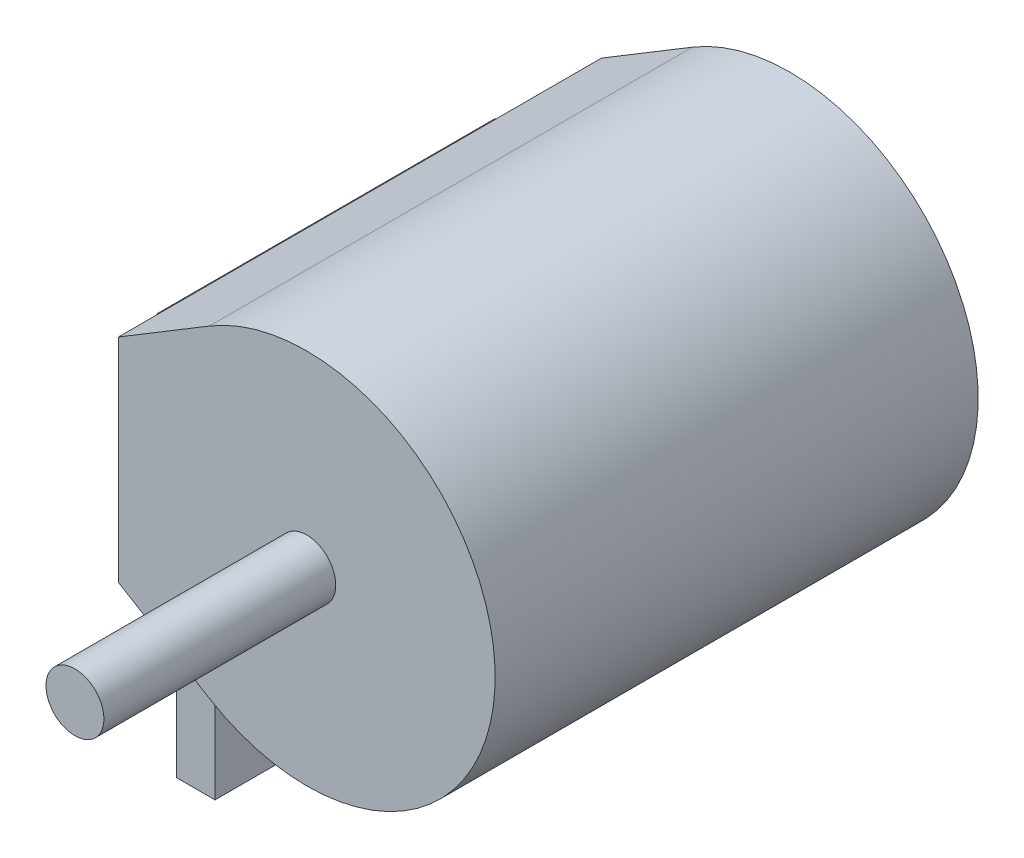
from build123d import *

# Parameters (mm, degrees)
BASE_EXTRUSION_DEPTH    = 12.5
ESQUISSE2_W             = 17.5
ESQUISSE2_H             = 9.08458566
ESQUISSE2_W_2           = 15.5
ESQUISSE2_H_2           = 7.08458566
BOS_EXTRU_MINCE1_DEPTH  = 1
ESQUISSE3_W             = 19
ESQUISSE3_H             = 10.25
BOSS_EXTRU_1_DEPTH      = 2
ENL_V_MAT_EXTRU_1_REACH = 30.01
ESQUISSE4_R             = 1.75
ESQUISSE5_R             = 1.5
BOSS_EXTRU_2_DEPTH      = 12


with BuildPart() as part:
    # Esquisse1 → Base-Extrusion (new, symmetric)
    with BuildSketch(Plane.XY):
        with BuildLine():
            Line((-9.75, 5.5), (-9.75, -5.5))
            Line((-9.75, -5.5), (-5.04276808, -8.344638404))
            ThreePointArc((-5.04276808, -8.344638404), (9.75, 0), (-5.04276808, 8.344638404))
            Line((-5.04276808, 8.344638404), (-9.75, 5.5))
        make_face()
    extrude(amount=BASE_EXTRUSION_DEPTH, both=True)

    # Esquisse2 → Bos.-Extru.-Mince1 (add)
    with BuildSketch(Plane.ZY.offset(9.75)):
        with Locations((0.75, 0)):
            Rectangle(ESQUISSE2_W, ESQUISSE2_H)
        with Locations((0.75, 0)):
            Rectangle(ESQUISSE2_W_2, ESQUISSE2_H_2, mode=Mode.SUBTRACT)
    extrude(amount=BOS_EXTRU_MINCE1_DEPTH)

    # Esquisse3 → Boss.-Extru.1 (add)
    with BuildSketch(Plane.ZY.offset(9.75)):
        with Locations((0, -10.625)):
            Rectangle(ESQUISSE3_W, ESQUISSE3_H)
    extrude(amount=-BOSS_EXTRU_1_DEPTH)

    # Esquisse4 → Enl_v. mat.-Extru.1 (cut, up to next)
    with BuildSketch(Plane.ZY.offset(9.75), mode=Mode.PRIVATE) as enl_v_mat_extru_1_sk1:
        with Locations(Location((0, -11, 0), (0, 0, 270))):
            Circle(ESQUISSE4_R)
    enl_v_mat_extru_1_tool1 = extrude(enl_v_mat_extru_1_sk1.sketch, amount=-ENL_V_MAT_EXTRU_1_REACH, mode=Mode.PRIVATE) & part.part
    add(enl_v_mat_extru_1_tool1.solids().sort_by_distance((-9.75, -11, 0))[0], mode=Mode.SUBTRACT)

    # Esquisse5 → Boss.-Extru.2 (add)
    with BuildSketch(Plane.XY.offset(12.5)):
        Circle(ESQUISSE5_R)
    extrude(amount=BOSS_EXTRU_2_DEPTH)


solid = part.part
